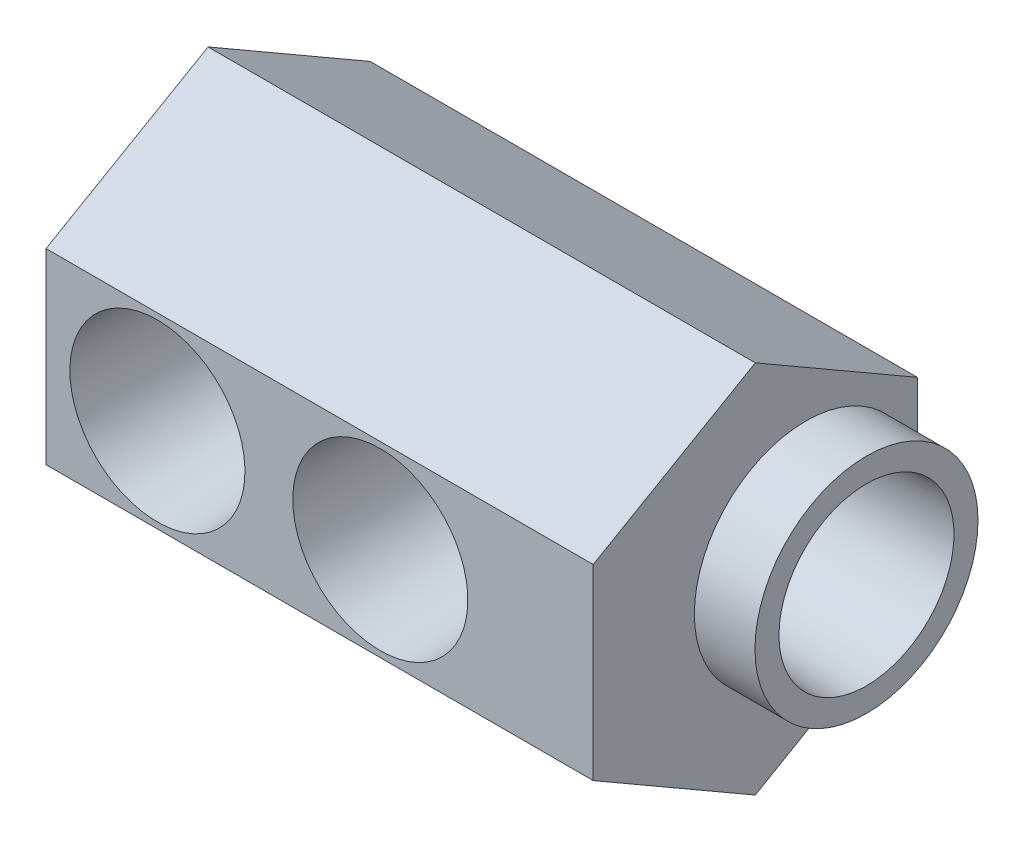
ISO-10303-21;
HEADER;
FILE_DESCRIPTION(('STEP AP214'),'2;1');
FILE_NAME('part.step','',(''),(''),'','','');
FILE_SCHEMA(('AUTOMOTIVE_DESIGN { 1 0 10303 214 1 1 1 1 }'));
ENDSEC;
DATA;
#1=APPLICATION_CONTEXT('core data for automotive mechanical design processes');
#2=APPLICATION_PROTOCOL_DEFINITION('international standard','automotive_design',2000,#1);
#3=PRODUCT_CONTEXT('',#1,'mechanical');
#4=PRODUCT('Part','Part','',(#3));
#5=PRODUCT_RELATED_PRODUCT_CATEGORY('part','',(#4));
#6=PRODUCT_DEFINITION_FORMATION('','',#4);
#7=PRODUCT_DEFINITION_CONTEXT('part definition',#1,'design');
#8=PRODUCT_DEFINITION('design','',#6,#7);
#9=PRODUCT_DEFINITION_SHAPE('','',#8);
#10=(LENGTH_UNIT() NAMED_UNIT(*) SI_UNIT(.MILLI.,.METRE.));
#11=(NAMED_UNIT(*) PLANE_ANGLE_UNIT() SI_UNIT($,.RADIAN.));
#12=(NAMED_UNIT(*) SI_UNIT($,.STERADIAN.) SOLID_ANGLE_UNIT());
#13=UNCERTAINTY_MEASURE_WITH_UNIT(LENGTH_MEASURE(1.E-05),#10,'distance_accuracy_value','');
#14=(GEOMETRIC_REPRESENTATION_CONTEXT(3) GLOBAL_UNCERTAINTY_ASSIGNED_CONTEXT((#13)) GLOBAL_UNIT_ASSIGNED_CONTEXT((#10,
#11,#12)) REPRESENTATION_CONTEXT('',''));
#15=CARTESIAN_POINT('',(0.,0.,0.));
#16=DIRECTION('',(0.,0.,1.));
#17=DIRECTION('',(1.,0.,0.));
#18=AXIS2_PLACEMENT_3D('',#15,#16,#17);
#19=CARTESIAN_POINT('',(47.625,0.,8.7376));
#20=DIRECTION('',(-1.,0.,0.));
#21=DIRECTION('',(0.,0.,1.));
#22=AXIS2_PLACEMENT_3D('',#19,#20,#21);
#23=PLANE('',#22);
#24=CARTESIAN_POINT('',(47.625,0.,8.7376));
#25=DIRECTION('',(-1.,0.,0.));
#26=DIRECTION('',(0.,1.,0.));
#27=AXIS2_PLACEMENT_3D('',#24,#25,#26);
#28=CIRCLE('',#27,8.7376);
#29=CARTESIAN_POINT('',(47.625,8.7376,8.7376));
#30=VERTEX_POINT('',#29);
#31=EDGE_CURVE('E199',#30,#30,#28,.T.);
#32=ORIENTED_EDGE('',*,*,#31,.F.);
#33=EDGE_LOOP('',(#32));
#34=FACE_BOUND('',#33,.T.);
#35=CARTESIAN_POINT('',(47.625,0.,8.7376));
#36=DIRECTION('',(-1.,0.,0.));
#37=DIRECTION('',(0.,0.,1.));
#38=AXIS2_PLACEMENT_3D('',#35,#36,#37);
#39=CIRCLE('',#38,6.85802318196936);
#40=CARTESIAN_POINT('',(47.625,0.,15.5956231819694));
#41=VERTEX_POINT('',#40);
#42=EDGE_CURVE('E384',#41,#41,#39,.T.);
#43=ORIENTED_EDGE('',*,*,#42,.T.);
#44=EDGE_LOOP('',(#43));
#45=FACE_BOUND('',#44,.T.);
#46=ADVANCED_FACE('F16',(#34,#45),#23,.F.);
#47=CARTESIAN_POINT('',(8.73125,0.,3.24017419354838));
#48=DIRECTION('',(0.,0.,-1.));
#49=DIRECTION('',(-1.,0.,0.));
#50=AXIS2_PLACEMENT_3D('',#47,#48,#49);
#51=CYLINDRICAL_SURFACE('',#50,5.55625);
#52=CARTESIAN_POINT('',(8.73125,0.,13.2293295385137));
#53=DIRECTION('',(0.,0.,-1.));
#54=DIRECTION('',(-1.,0.,0.));
#55=AXIS2_PLACEMENT_3D('',#52,#53,#54);
#56=CIRCLE('',#55,5.55625);
#57=CARTESIAN_POINT('',(3.175,0.,13.2293295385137));
#58=VERTEX_POINT('',#57);
#59=EDGE_CURVE('E222',#58,#58,#56,.T.);
#60=ORIENTED_EDGE('',*,*,#59,.F.);
#61=EDGE_LOOP('',(#60));
#62=FACE_BOUND('',#61,.T.);
#63=CARTESIAN_POINT('',(8.73125,0.,5.81662318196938));
#64=DIRECTION('',(0.,0.,-1.));
#65=DIRECTION('',(-1.,0.,0.));
#66=AXIS2_PLACEMENT_3D('',#63,#64,#65);
#67=CIRCLE('',#66,5.55625);
#68=CARTESIAN_POINT('',(14.2874756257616,-0.0164577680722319,5.81662318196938));
#69=VERTEX_POINT('',#68);
#70=CARTESIAN_POINT('',(14.2874756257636,0.016457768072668,5.81662318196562));
#71=VERTEX_POINT('',#70);
#72=EDGE_CURVE('E225',#69,#71,#67,.T.);
#73=ORIENTED_EDGE('',*,*,#72,.T.);
#74=CARTESIAN_POINT('',(14.2875,0.,11.6586231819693));
#75=CARTESIAN_POINT('',(14.2874896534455,-0.15259620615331,11.6586111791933));
#76=CARTESIAN_POINT('',(14.2811471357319,-0.305352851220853,11.6465945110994));
#77=CARTESIAN_POINT('',(14.2563955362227,-0.606286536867,11.5990837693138));
#78=CARTESIAN_POINT('',(14.237966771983,-0.754455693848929,11.5635513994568));
#79=CARTESIAN_POINT('',(14.1909586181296,-1.04142033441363,11.4708153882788));
#80=CARTESIAN_POINT('',(14.1624199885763,-1.18025083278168,11.4136987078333));
#81=CARTESIAN_POINT('',(14.0977578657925,-1.44611723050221,11.2799010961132));
#82=CARTESIAN_POINT('',(14.0616344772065,-1.57315329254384,11.2032204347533));
#83=CARTESIAN_POINT('',(13.9823036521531,-1.82109036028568,11.026840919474));
#84=CARTESIAN_POINT('',(13.9387887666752,-1.9410595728,10.925972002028));
#85=CARTESIAN_POINT('',(13.8504908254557,-2.16324055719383,10.7066582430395));
#86=CARTESIAN_POINT('',(13.805706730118,-2.26543725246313,10.5881986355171));
#87=CARTESIAN_POINT('',(13.7153353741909,-2.45827606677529,10.3244738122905));
#88=CARTESIAN_POINT('',(13.6700240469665,-2.54711079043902,10.1777672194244));
#89=CARTESIAN_POINT('',(13.6092642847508,-2.66059008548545,9.94633632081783));
#90=CARTESIAN_POINT('',(13.5902071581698,-2.69512914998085,9.8672696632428));
#91=CARTESIAN_POINT('',(13.5552265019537,-2.75725124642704,9.70579919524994));
#92=CARTESIAN_POINT('',(13.5393010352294,-2.78483858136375,9.62339748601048));
#93=CARTESIAN_POINT('',(13.512134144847,-2.83120816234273,9.46101134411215));
#94=CARTESIAN_POINT('',(13.5006649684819,-2.8504274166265,9.38118968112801));
#95=CARTESIAN_POINT('',(13.4815807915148,-2.88211974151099,9.21980284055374));
#96=CARTESIAN_POINT('',(13.4739636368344,-2.89459658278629,9.13823866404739));
#97=CARTESIAN_POINT('',(13.4629292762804,-2.91260026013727,8.97411952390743));
#98=CARTESIAN_POINT('',(13.4595088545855,-2.91813241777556,8.89156536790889));
#99=CARTESIAN_POINT('',(13.4570108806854,-2.92217297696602,8.72624813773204));
#100=CARTESIAN_POINT('',(13.4579328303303,-2.92068218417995,8.64348508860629));
#101=CARTESIAN_POINT('',(13.4663528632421,-2.90703905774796,8.4185200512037));
#102=CARTESIAN_POINT('',(13.4781425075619,-2.88792697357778,8.27682524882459));
#103=CARTESIAN_POINT('',(13.5130659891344,-2.82970982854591,7.99915201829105));
#104=CARTESIAN_POINT('',(13.5362041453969,-2.79059715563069,7.86317578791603));
#105=CARTESIAN_POINT('',(13.5916565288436,-2.69287438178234,7.59681806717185));
#106=CARTESIAN_POINT('',(13.6241676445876,-2.63384072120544,7.46663439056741));
#107=CARTESIAN_POINT('',(13.6947461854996,-2.49828969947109,7.21737534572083));
#108=CARTESIAN_POINT('',(13.7328160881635,-2.42176453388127,7.09830496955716));
#109=CARTESIAN_POINT('',(13.816745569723,-2.240747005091,6.85682529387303));
#110=CARTESIAN_POINT('',(13.8629431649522,-2.13382537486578,6.73634759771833));
#111=CARTESIAN_POINT('',(13.953590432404,-1.90122661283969,6.51417949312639));
#112=CARTESIAN_POINT('',(13.9980390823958,-1.77553871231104,6.41249994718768));
#113=CARTESIAN_POINT('',(14.0832180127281,-1.50008532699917,6.2253585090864));
#114=CARTESIAN_POINT('',(14.1235977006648,-1.3493622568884,6.14113310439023));
#115=CARTESIAN_POINT('',(14.1929742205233,-1.03323698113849,5.99995715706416));
#116=CARTESIAN_POINT('',(14.2219809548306,-0.867847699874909,5.94298287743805));
#117=CARTESIAN_POINT('',(14.2631394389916,-0.542727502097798,5.8630001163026));
#118=CARTESIAN_POINT('',(14.276553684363,-0.383787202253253,5.83743593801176));
#119=CARTESIAN_POINT('',(14.2894474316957,-0.0633361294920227,5.81285320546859));
#120=CARTESIAN_POINT('',(14.2889346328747,0.0981731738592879,5.81381998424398));
#121=CARTESIAN_POINT('',(14.2747173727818,0.404088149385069,5.84094786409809));
#122=CARTESIAN_POINT('',(14.2621723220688,0.548752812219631,5.86489474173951));
#123=CARTESIAN_POINT('',(14.2267538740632,0.831675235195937,5.93369322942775));
#124=CARTESIAN_POINT('',(14.2038793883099,0.969932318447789,5.97854704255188));
#125=CARTESIAN_POINT('',(14.1490945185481,1.2403273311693,6.08885556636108));
#126=CARTESIAN_POINT('',(14.1169652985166,1.37221377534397,6.15481410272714));
#127=CARTESIAN_POINT('',(14.04664238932,1.62344149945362,6.30485449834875));
#128=CARTESIAN_POINT('',(14.0084462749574,1.74277773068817,6.38894360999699));
#129=CARTESIAN_POINT('',(13.9248124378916,1.97891877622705,6.58306704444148));
#130=CARTESIAN_POINT('',(13.8790359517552,2.09412511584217,6.69490359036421));
#131=CARTESIAN_POINT('',(13.7881677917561,2.30492907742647,6.93610234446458));
#132=CARTESIAN_POINT('',(13.7430767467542,2.40050959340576,7.06547967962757));
#133=CARTESIAN_POINT('',(13.6557324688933,2.57517665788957,7.34832460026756));
#134=CARTESIAN_POINT('',(13.6138350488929,2.65285121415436,7.50279459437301));
#135=CARTESIAN_POINT('',(13.5602699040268,2.74841964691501,7.74457321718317));
#136=CARTESIAN_POINT('',(13.5439608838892,2.77678645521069,7.82685103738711));
#137=CARTESIAN_POINT('',(13.5151191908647,2.82618660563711,7.9942030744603));
#138=CARTESIAN_POINT('',(13.5025839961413,2.84722484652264,8.07927538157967));
#139=CARTESIAN_POINT('',(13.4828953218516,2.87994941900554,8.24307900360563));
#140=CARTESIAN_POINT('',(13.4753364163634,2.89234733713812,8.32162029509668));
#141=CARTESIAN_POINT('',(13.4640974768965,2.91070188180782,8.47969137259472));
#142=CARTESIAN_POINT('',(13.4604153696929,2.91666195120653,8.55922060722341));
#143=CARTESIAN_POINT('',(13.4570897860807,2.92204798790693,8.71856620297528));
#144=CARTESIAN_POINT('',(13.4574451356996,2.92147585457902,8.79838247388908));
#145=CARTESIAN_POINT('',(13.4621667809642,2.91382109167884,8.95755809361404));
#146=CARTESIAN_POINT('',(13.4665328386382,2.90673884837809,9.03691746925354));
#147=CARTESIAN_POINT('',(13.4839443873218,2.87824767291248,9.25505555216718));
#148=CARTESIAN_POINT('',(13.501079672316,2.85001452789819,9.39268570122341));
#149=CARTESIAN_POINT('',(13.5452382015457,2.77476023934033,9.66093584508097));
#150=CARTESIAN_POINT('',(13.5722649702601,2.72773239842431,9.79155332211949));
#151=CARTESIAN_POINT('',(13.6352781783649,2.61284865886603,10.0517219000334));
#152=CARTESIAN_POINT('',(13.6717352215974,2.54383110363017,10.1806437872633));
#153=CARTESIAN_POINT('',(13.7488608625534,2.38810346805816,10.4259340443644));
#154=CARTESIAN_POINT('',(13.7895317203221,2.30138386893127,10.5422956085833));
#155=CARTESIAN_POINT('',(13.8772656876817,2.09863618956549,10.7760458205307));
#156=CARTESIAN_POINT('',(13.9244305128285,1.98020868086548,10.8913226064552));
#157=CARTESIAN_POINT('',(14.0148356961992,1.72452153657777,11.1010091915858));
#158=CARTESIAN_POINT('',(14.0580736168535,1.58725033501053,11.1954060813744));
#159=CARTESIAN_POINT('',(14.1169832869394,1.36810411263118,11.3198355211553));
#160=CARTESIAN_POINT('',(14.1357898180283,1.29199681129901,11.3587585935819));
#161=CARTESIAN_POINT('',(14.1706822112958,1.13615616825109,11.4299693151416));
#162=CARTESIAN_POINT('',(14.1867694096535,1.05642463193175,11.4622602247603));
#163=CARTESIAN_POINT('',(14.2157134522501,0.894070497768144,11.5197604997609));
#164=CARTESIAN_POINT('',(14.2285769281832,0.811454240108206,11.5449844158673));
#165=CARTESIAN_POINT('',(14.2507105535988,0.643897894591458,11.5880823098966));
#166=CARTESIAN_POINT('',(14.2599827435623,0.558959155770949,11.6059604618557));
#167=CARTESIAN_POINT('',(14.2739773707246,0.395235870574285,11.6328390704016));
#168=CARTESIAN_POINT('',(14.2790348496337,0.316587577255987,11.642495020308));
#169=CARTESIAN_POINT('',(14.285798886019,0.15864065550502,11.6553902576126));
#170=CARTESIAN_POINT('',(14.2875053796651,0.0793420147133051,11.6586294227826));
#171=CARTESIAN_POINT('',(14.2875,0.,11.6586231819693));
#172=B_SPLINE_CURVE_WITH_KNOTS('',3,(#74,#75,#76,#77,#78,#79,#80,#81,#82,#83,#84,#85,#86,#87,
#88,#89,#90,#91,#92,#93,#94,#95,#96,#97,#98,#99,#100,#101,#102,#103,#104,#105,#106,#107,#108,
#109,#110,#111,#112,#113,#114,#115,#116,#117,#118,#119,#120,#121,#122,#123,#124,#125,#126,#127,
#128,#129,#130,#131,#132,#133,#134,#135,#136,#137,#138,#139,#140,#141,#142,#143,#144,#145,#146,
#147,#148,#149,#150,#151,#152,#153,#154,#155,#156,#157,#158,#159,#160,#161,#162,#163,#164,#165,
#166,#167,#168,#169,#170,#171),.UNSPECIFIED.,.T.,.F.,(4,2,2,2,2,2,2,2,2,2,2,2,2,2,2,2,2,2,2,2,2,
2,2,2,2,2,2,2,2,2,2,2,2,2,2,2,2,2,2,2,2,2,2,2,2,2,2,2,4),(0.,0.457481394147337,
0.915709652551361,1.3721111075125,1.82850626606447,2.31449222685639,2.80088846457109,
3.33007409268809,3.59484099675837,3.85944361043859,4.10778110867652,4.35597958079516,
4.603987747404,4.85196746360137,5.28013319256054,5.70846199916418,6.14654100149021,
6.58481585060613,7.0853946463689,7.58626180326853,8.11534843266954,8.6439733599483,
9.12590436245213,9.60756894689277,10.047043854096,10.4865650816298,10.9374783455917,
11.3885723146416,11.887308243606,12.3864770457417,12.9169799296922,13.1822678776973,
13.4473781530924,13.6866517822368,13.9257973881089,14.1648734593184,14.4039353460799,
14.8264992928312,15.2492139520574,15.6995927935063,16.1502144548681,16.6635646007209,
17.1772312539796,17.4395064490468,17.7016523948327,17.9632545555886,18.2247078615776,
18.4625696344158,18.7004359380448),.UNSPECIFIED.);
#173=EDGE_CURVE('E145',#71,#69,#172,.T.);
#174=ORIENTED_EDGE('',*,*,#173,.T.);
#175=EDGE_LOOP('',(#73,#174));
#176=FACE_BOUND('',#175,.T.);
#177=ADVANCED_FACE('F240',(#62,#176),#51,.F.);
#178=CARTESIAN_POINT('',(8.73125,0.,5.81662318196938));
#179=DIRECTION('',(0.,0.,1.));
#180=DIRECTION('',(1.,0.,0.));
#181=AXIS2_PLACEMENT_3D('',#178,#179,#180);
#182=PLANE('',#181);
#183=DIRECTION('',(0.,1.,0.));
#184=VECTOR('',#183,1.);
#185=CARTESIAN_POINT('',(8.73125,0.,5.81662318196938));
#186=LINE('',#185,#184);
#187=CARTESIAN_POINT('',(8.73125,-0.0164577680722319,5.81662318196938));
#188=VERTEX_POINT('',#187);
#189=CARTESIAN_POINT('',(8.73125,0.0164577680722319,5.81662318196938));
#190=VERTEX_POINT('',#189);
#191=EDGE_CURVE('E151',#188,#190,#186,.T.);
#192=ORIENTED_EDGE('',*,*,#191,.T.);
#193=DIRECTION('',(-1.,0.,0.));
#194=VECTOR('',#193,1.);
#195=CARTESIAN_POINT('',(52.3612796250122,0.0164577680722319,5.81662318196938));
#196=LINE('',#195,#194);
#197=EDGE_CURVE('E30',#190,#71,#196,.F.);
#198=ORIENTED_EDGE('',*,*,#197,.T.);
#199=ORIENTED_EDGE('',*,*,#72,.F.);
#200=DIRECTION('',(-1.,0.,0.));
#201=VECTOR('',#200,1.);
#202=CARTESIAN_POINT('',(52.3612796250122,-0.0164577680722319,5.81662318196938));
#203=LINE('',#202,#201);
#204=EDGE_CURVE('E148',#69,#188,#203,.T.);
#205=ORIENTED_EDGE('',*,*,#204,.T.);
#206=EDGE_LOOP('',(#192,#198,#199,#205));
#207=FACE_BOUND('',#206,.T.);
#208=ADVANCED_FACE('F256',(#207),#182,.T.);
#209=CARTESIAN_POINT('',(26.19375,0.,37.2802064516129));
#210=DIRECTION('',(0.,0.,-1.));
#211=DIRECTION('',(-1.,0.,0.));
#212=AXIS2_PLACEMENT_3D('',#209,#210,#211);
#213=CYLINDRICAL_SURFACE('',#212,5.55625);
#214=CARTESIAN_POINT('',(20.6375,0.,12.0523));
#215=CARTESIAN_POINT('',(20.6375006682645,0.0848998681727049,12.0522992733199));
#216=CARTESIAN_POINT('',(20.6394510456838,0.169823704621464,12.0490328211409));
#217=CARTESIAN_POINT('',(20.6472055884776,0.339030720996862,12.036009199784));
#218=CARTESIAN_POINT('',(20.6530120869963,0.423313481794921,12.0262481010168));
#219=CARTESIAN_POINT('',(20.6683509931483,0.590722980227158,12.000339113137));
#220=CARTESIAN_POINT('',(20.6778906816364,0.673847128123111,11.9841787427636));
#221=CARTESIAN_POINT('',(20.7004575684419,0.838182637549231,11.9456870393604));
#222=CARTESIAN_POINT('',(20.7134862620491,0.919393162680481,11.9233530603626));
#223=CARTESIAN_POINT('',(20.7572128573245,1.15846258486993,11.8477406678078));
#224=CARTESIAN_POINT('',(20.7926508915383,1.31278558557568,11.7856889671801));
#225=CARTESIAN_POINT('',(20.8731373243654,1.60826775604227,11.6406782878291));
#226=CARTESIAN_POINT('',(20.9181831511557,1.74943043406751,11.5577249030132));
#227=CARTESIAN_POINT('',(21.018117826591,2.02683861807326,11.3662260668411));
#228=CARTESIAN_POINT('',(21.0734945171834,2.16189544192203,11.2562149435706));
#229=CARTESIAN_POINT('',(21.1868221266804,2.41279729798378,11.0170191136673));
#230=CARTESIAN_POINT('',(21.2447762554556,2.52861747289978,10.8878100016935));
#231=CARTESIAN_POINT('',(21.3650287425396,2.75196381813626,10.5954878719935));
#232=CARTESIAN_POINT('',(21.4270052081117,2.85679430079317,10.4301644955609));
#233=CARTESIAN_POINT('',(21.5395924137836,3.03678309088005,10.0806063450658));
#234=CARTESIAN_POINT('',(21.5902214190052,3.11198923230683,9.89640266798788));
#235=CARTESIAN_POINT('',(21.661695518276,3.2148628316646,9.55924527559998));
#236=CARTESIAN_POINT('',(21.6867672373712,3.24959670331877,9.40934725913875));
#237=CARTESIAN_POINT('',(21.7220037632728,3.29792815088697,9.10453594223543));
#238=CARTESIAN_POINT('',(21.7321867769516,3.31155154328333,8.94962900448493));
#239=CARTESIAN_POINT('',(21.7361449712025,3.31687918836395,8.6389309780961));
#240=CARTESIAN_POINT('',(21.7298892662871,3.30854218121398,8.48313877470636));
#241=CARTESIAN_POINT('',(21.70186851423,3.27038915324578,8.17560124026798));
#242=CARTESIAN_POINT('',(21.6800919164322,3.24055713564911,8.0238590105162));
#243=CARTESIAN_POINT('',(21.6243558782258,3.16145974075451,7.72996747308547));
#244=CARTESIAN_POINT('',(21.5905420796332,3.1124260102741,7.58772664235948));
#245=CARTESIAN_POINT('',(21.5143900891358,2.99671392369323,7.31310864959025));
#246=CARTESIAN_POINT('',(21.4720487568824,2.93002906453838,7.18073514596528));
#247=CARTESIAN_POINT('',(21.3747487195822,2.76759060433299,6.90525821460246));
#248=CARTESIAN_POINT('',(21.3188746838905,2.66880321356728,6.76426446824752));
#249=CARTESIAN_POINT('',(21.2057867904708,2.45096949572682,6.49941895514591));
#250=CARTESIAN_POINT('',(21.1485717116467,2.33190403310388,6.37558358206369));
#251=CARTESIAN_POINT('',(21.0300359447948,2.05745912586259,6.13142170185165));
#252=CARTESIAN_POINT('',(20.9692162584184,1.89934283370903,6.01386647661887));
#253=CARTESIAN_POINT('',(20.8863182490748,1.64651433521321,5.85905395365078));
#254=CARTESIAN_POINT('',(20.8600645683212,1.55958796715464,5.81102030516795));
#255=CARTESIAN_POINT('',(20.8110626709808,1.38099210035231,5.72263669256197));
#256=CARTESIAN_POINT('',(20.7883123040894,1.28932555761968,5.68228201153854));
#257=CARTESIAN_POINT('',(20.7483212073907,1.10783713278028,5.61209316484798));
#258=CARTESIAN_POINT('',(20.7308225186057,1.01826711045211,5.58175401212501));
#259=CARTESIAN_POINT('',(20.7000136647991,0.83623397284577,5.52871739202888));
#260=CARTESIAN_POINT('',(20.6867011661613,0.74377250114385,5.50601566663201));
#261=CARTESIAN_POINT('',(20.6646656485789,0.556773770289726,5.46860560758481));
#262=CARTESIAN_POINT('',(20.6559393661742,0.462238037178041,5.45389158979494));
#263=CARTESIAN_POINT('',(20.6433395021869,0.271933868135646,5.43268670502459));
#264=CARTESIAN_POINT('',(20.6394652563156,0.176165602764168,5.42619471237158));
#265=CARTESIAN_POINT('',(20.6368804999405,-0.00274738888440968,5.42186133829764));
#266=CARTESIAN_POINT('',(20.6375460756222,-0.0858591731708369,5.4229747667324));
#267=CARTESIAN_POINT('',(20.64258086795,-0.251661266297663,5.43142284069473));
#268=CARTESIAN_POINT('',(20.6469512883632,-0.334351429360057,5.43875950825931));
#269=CARTESIAN_POINT('',(20.6654933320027,-0.580774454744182,5.469991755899));
#270=CARTESIAN_POINT('',(20.6850933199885,-0.743049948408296,5.50310528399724));
#271=CARTESIAN_POINT('',(20.7363849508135,-1.05529159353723,5.59127014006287));
#272=CARTESIAN_POINT('',(20.7677949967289,-1.20545240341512,5.64581180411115));
#273=CARTESIAN_POINT('',(20.8401912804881,-1.49449947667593,5.77470371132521));
#274=CARTESIAN_POINT('',(20.8811794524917,-1.63338345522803,5.84905795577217));
#275=CARTESIAN_POINT('',(20.9743880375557,-1.91150931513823,6.02409363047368));
#276=CARTESIAN_POINT('',(21.0273331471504,-2.04928760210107,6.12670835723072));
#277=CARTESIAN_POINT('',(21.1370139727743,-2.30671992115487,6.3510780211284));
#278=CARTESIAN_POINT('',(21.1937540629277,-2.42635250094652,6.47285527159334));
#279=CARTESIAN_POINT('',(21.3135439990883,-2.65985525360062,6.7502963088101));
#280=CARTESIAN_POINT('',(21.3764707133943,-2.77102268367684,6.90830275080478));
#281=CARTESIAN_POINT('',(21.4935403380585,-2.9652705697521,7.24366324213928));
#282=CARTESIAN_POINT('',(21.5476928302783,-3.04838177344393,7.42099582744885));
#283=CARTESIAN_POINT('',(21.628943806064,-3.16836543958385,7.75141976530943));
#284=CARTESIAN_POINT('',(21.6593598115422,-3.21134894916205,7.90146793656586));
#285=CARTESIAN_POINT('',(21.7057564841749,-3.27588840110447,8.2081933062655));
#286=CARTESIAN_POINT('',(21.7217567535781,-3.29747344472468,8.36486119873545));
#287=CARTESIAN_POINT('',(21.7369709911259,-3.31801462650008,8.68108111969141));
#288=CARTESIAN_POINT('',(21.7361258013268,-3.31689101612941,8.84064134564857));
#289=CARTESIAN_POINT('',(21.7176364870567,-3.29189001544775,9.15701215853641));
#290=CARTESIAN_POINT('',(21.6999829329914,-3.26799985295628,9.31382115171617));
#291=CARTESIAN_POINT('',(21.6516365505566,-3.20042554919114,9.61343308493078));
#292=CARTESIAN_POINT('',(21.6215535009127,-3.15766140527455,9.75654873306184));
#293=CARTESIAN_POINT('',(21.5519202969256,-3.05437348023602,10.033725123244));
#294=CARTESIAN_POINT('',(21.5123665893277,-2.99384303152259,10.1677824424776));
#295=CARTESIAN_POINT('',(21.4208349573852,-2.846023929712,10.4451565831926));
#296=CARTESIAN_POINT('',(21.3678817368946,-2.75604928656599,10.5867170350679));
#297=CARTESIAN_POINT('',(21.2592344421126,-2.55644202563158,10.8541330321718));
#298=CARTESIAN_POINT('',(21.2035381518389,-2.44679331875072,10.979975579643));
#299=CARTESIAN_POINT('',(21.0852845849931,-2.19053379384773,11.2328232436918));
#300=CARTESIAN_POINT('',(21.02303876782,-2.04081916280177,11.3568522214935));
#301=CARTESIAN_POINT('',(20.9074658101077,-1.71935409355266,11.5782050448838));
#302=CARTESIAN_POINT('',(20.8541416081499,-1.54759642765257,11.6755200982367));
#303=CARTESIAN_POINT('',(20.7861500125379,-1.27982168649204,11.7967671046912));
#304=CARTESIAN_POINT('',(20.7657416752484,-1.1905040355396,11.8326406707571));
#305=CARTESIAN_POINT('',(20.7289781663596,-1.00835855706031,11.8966737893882));
#306=CARTESIAN_POINT('',(20.7126206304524,-0.915532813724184,11.9248378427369));
#307=CARTESIAN_POINT('',(20.6845008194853,-0.727402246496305,11.9729557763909));
#308=CARTESIAN_POINT('',(20.6727250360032,-0.632105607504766,11.9929338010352));
#309=CARTESIAN_POINT('',(20.6540844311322,-0.439706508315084,12.0244495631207));
#310=CARTESIAN_POINT('',(20.6472154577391,-0.342605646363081,12.0359944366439));
#311=CARTESIAN_POINT('',(20.6411090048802,-0.204357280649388,12.0462474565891));
#312=CARTESIAN_POINT('',(20.6397566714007,-0.163533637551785,12.0485160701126));
#313=CARTESIAN_POINT('',(20.6379519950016,-0.0818085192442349,12.0515425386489));
#314=CARTESIAN_POINT('',(20.6374996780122,-0.0409070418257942,12.052300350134));
#315=CARTESIAN_POINT('',(20.6375,0.,12.0523));
#316=B_SPLINE_CURVE_WITH_KNOTS('',3,(#214,#215,#216,#217,#218,#219,#220,#221,#222,#223,#224,
#225,#226,#227,#228,#229,#230,#231,#232,#233,#234,#235,#236,#237,#238,#239,#240,#241,#242,#243,
#244,#245,#246,#247,#248,#249,#250,#251,#252,#253,#254,#255,#256,#257,#258,#259,#260,#261,#262,
#263,#264,#265,#266,#267,#268,#269,#270,#271,#272,#273,#274,#275,#276,#277,#278,#279,#280,#281,
#282,#283,#284,#285,#286,#287,#288,#289,#290,#291,#292,#293,#294,#295,#296,#297,#298,#299,#300,
#301,#302,#303,#304,#305,#306,#307,#308,#309,#310,#311,#312,#313,#314,#315),.UNSPECIFIED.,.T.,
.F.,(4,2,2,2,2,2,2,2,2,2,2,2,2,2,2,2,2,2,2,2,2,2,2,2,2,2,2,2,2,2,2,2,2,2,2,2,2,2,2,2,2,2,2,2,2,
2,2,2,2,2,4),(0.,0.254656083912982,0.509466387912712,0.764776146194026,1.02019549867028,
1.52794272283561,2.03555420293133,2.58173686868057,3.12861990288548,3.74162141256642,
4.35362901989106,4.81933942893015,5.28447985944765,5.75049483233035,6.2168569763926,
6.67775821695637,7.13882950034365,7.67972067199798,8.22112511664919,8.83621320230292,
9.14402495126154,9.45164700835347,9.73975475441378,10.0277016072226,10.3154432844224,
10.6031455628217,10.852188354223,11.1013120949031,11.5989968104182,12.0854984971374,
12.5720985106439,13.1092818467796,13.6470953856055,14.2538243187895,14.8598861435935,
15.3349731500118,15.8094131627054,16.2855196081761,16.7618933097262,17.2172454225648,
17.6727686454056,18.1984855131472,18.7246342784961,19.3341634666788,19.9438930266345,
20.2387017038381,20.5333379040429,20.827098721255,21.1206106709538,21.243307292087,
21.3660074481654),.UNSPECIFIED.);
#317=CARTESIAN_POINT('',(20.6375,0.,12.0523));
#318=VERTEX_POINT('',#317);
#319=EDGE_CURVE('E21',#318,#318,#316,.T.);
#320=ORIENTED_EDGE('',*,*,#319,.T.);
#321=EDGE_LOOP('',(#320));
#322=FACE_BOUND('',#321,.T.);
#323=CARTESIAN_POINT('',(26.19375,0.,13.2293295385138));
#324=DIRECTION('',(0.,0.,-1.));
#325=DIRECTION('',(-1.,0.,0.));
#326=AXIS2_PLACEMENT_3D('',#323,#324,#325);
#327=CIRCLE('',#326,5.55625);
#328=CARTESIAN_POINT('',(31.6414346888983,-1.09299844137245,13.2293295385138));
#329=VERTEX_POINT('',#328);
#330=CARTESIAN_POINT('',(31.6414346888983,1.09299844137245,13.2293295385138));
#331=VERTEX_POINT('',#330);
#332=EDGE_CURVE('E144',#329,#331,#327,.T.);
#333=ORIENTED_EDGE('',*,*,#332,.F.);
#334=CARTESIAN_POINT('',(31.6414346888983,-1.09299844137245,13.2293295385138));
#335=CARTESIAN_POINT('',(31.6169490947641,-1.21516001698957,13.1996233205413));
#336=CARTESIAN_POINT('',(31.5885510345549,-1.33528320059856,13.165096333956));
#337=CARTESIAN_POINT('',(31.5248011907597,-1.5705300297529,13.0871970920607));
#338=CARTESIAN_POINT('',(31.4894593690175,-1.68566055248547,13.0438375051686));
#339=CARTESIAN_POINT('',(31.4129799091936,-1.90929550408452,12.9494263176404));
#340=CARTESIAN_POINT('',(31.3718998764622,-2.01785204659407,12.8984508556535));
#341=CARTESIAN_POINT('',(31.2845503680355,-2.22906649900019,12.7892275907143));
#342=CARTESIAN_POINT('',(31.2382790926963,-2.33172234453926,12.7309772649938));
#343=CARTESIAN_POINT('',(31.0935359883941,-2.6291392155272,12.5470627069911));
#344=CARTESIAN_POINT('',(30.9886141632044,-2.81481546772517,12.4116016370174));
#345=CARTESIAN_POINT('',(30.7677468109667,-3.16114479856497,12.1183144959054));
#346=CARTESIAN_POINT('',(30.6517632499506,-3.32170613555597,11.9604102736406));
#347=CARTESIAN_POINT('',(30.4636625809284,-3.55701756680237,11.6931838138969));
#348=CARTESIAN_POINT('',(30.3928586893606,-3.64013654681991,11.5901730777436));
#349=CARTESIAN_POINT('',(30.2512783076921,-3.79730936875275,11.3773413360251));
#350=CARTESIAN_POINT('',(30.1805018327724,-3.8713604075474,11.2675182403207));
#351=CARTESIAN_POINT('',(30.0408647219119,-4.01014903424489,11.0412030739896));
#352=CARTESIAN_POINT('',(29.9720018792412,-4.0748977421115,10.9247192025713));
#353=CARTESIAN_POINT('',(29.8383663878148,-4.19484729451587,10.6847807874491));
#354=CARTESIAN_POINT('',(29.7735913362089,-4.25005378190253,10.5613304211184));
#355=CARTESIAN_POINT('',(29.6391425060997,-4.36005463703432,10.2825268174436));
#356=CARTESIAN_POINT('',(29.5709229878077,-4.41272723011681,10.125604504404));
#357=CARTESIAN_POINT('',(29.4511191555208,-4.50189596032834,9.80125070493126));
#358=CARTESIAN_POINT('',(29.3994972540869,-4.53842871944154,9.63384400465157));
#359=CARTESIAN_POINT('',(29.3271488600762,-4.58861485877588,9.31749013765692));
#360=CARTESIAN_POINT('',(29.30281881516,-4.60497954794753,9.16983109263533));
#361=CARTESIAN_POINT('',(29.2755840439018,-4.62325852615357,8.87170940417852));
#362=CARTESIAN_POINT('',(29.2726544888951,-4.62518956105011,8.72125021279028));
#363=CARTESIAN_POINT('',(29.2887054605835,-4.6144592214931,8.42227270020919));
#364=CARTESIAN_POINT('',(29.3076629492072,-4.60181319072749,8.27375250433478));
#365=CARTESIAN_POINT('',(29.364222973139,-4.56301903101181,7.98203371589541));
#366=CARTESIAN_POINT('',(29.4018586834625,-4.53684687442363,7.83884508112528));
#367=CARTESIAN_POINT('',(29.4813063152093,-4.47947928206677,7.58991418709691));
#368=CARTESIAN_POINT('',(29.5204718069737,-4.45058072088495,7.48275033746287));
#369=CARTESIAN_POINT('',(29.6051121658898,-4.38604084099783,7.27303084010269));
#370=CARTESIAN_POINT('',(29.6505891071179,-4.35039730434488,7.17047672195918));
#371=CARTESIAN_POINT('',(29.7461495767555,-4.27272448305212,6.96962355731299));
#372=CARTESIAN_POINT('',(29.796247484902,-4.23067498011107,6.87133929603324));
#373=CARTESIAN_POINT('',(29.899425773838,-4.14060090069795,6.67921301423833));
#374=CARTESIAN_POINT('',(29.9525059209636,-4.09257679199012,6.58537064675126));
#375=CARTESIAN_POINT('',(30.081961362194,-3.97045074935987,6.36540015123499));
#376=CARTESIAN_POINT('',(30.159192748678,-3.89358171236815,6.24130355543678));
#377=CARTESIAN_POINT('',(30.3145491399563,-3.72877674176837,6.00123259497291));
#378=CARTESIAN_POINT('',(30.3926744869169,-3.6408364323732,5.88526147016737));
#379=CARTESIAN_POINT('',(30.5475772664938,-3.45409793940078,5.6617831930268));
#380=CARTESIAN_POINT('',(30.6243565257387,-3.35531604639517,5.55426374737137));
#381=CARTESIAN_POINT('',(30.7747992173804,-3.14681568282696,5.34800674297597));
#382=CARTESIAN_POINT('',(30.8484623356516,-3.03709611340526,5.24927006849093));
#383=CARTESIAN_POINT('',(31.0296178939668,-2.74407311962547,5.01027255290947));
#384=CARTESIAN_POINT('',(31.133758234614,-2.55316626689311,4.87657923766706));
#385=CARTESIAN_POINT('',(31.3234902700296,-2.14660197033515,4.63662991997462));
#386=CARTESIAN_POINT('',(31.4091058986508,-1.93097702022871,4.53033847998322));
#387=CARTESIAN_POINT('',(31.5431651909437,-1.51500653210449,4.36535535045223));
#388=CARTESIAN_POINT('',(31.595389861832,-1.31787986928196,4.30173357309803));
#389=CARTESIAN_POINT('',(31.6576234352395,-1.01425724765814,4.22622858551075));
#390=CARTESIAN_POINT('',(31.67567958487,-0.911775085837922,4.20438684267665));
#391=CARTESIAN_POINT('',(31.7061127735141,-0.704761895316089,4.16763088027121));
#392=CARTESIAN_POINT('',(31.7184925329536,-0.600231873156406,4.15271334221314));
#393=CARTESIAN_POINT('',(31.7350213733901,-0.415469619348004,4.13281151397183));
#394=CARTESIAN_POINT('',(31.7404398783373,-0.335509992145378,4.12629384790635));
#395=CARTESIAN_POINT('',(31.7478157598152,-0.175254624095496,4.11742529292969));
#396=CARTESIAN_POINT('',(31.7497754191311,-0.0949591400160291,4.11507165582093));
#397=CARTESIAN_POINT('',(31.7499807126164,-0.0146400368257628,4.11482318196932));
#398=B_SPLINE_CURVE_WITH_KNOTS('',3,(#334,#335,#336,#337,#338,#339,#340,#341,#342,#343,#344,
#345,#346,#347,#348,#349,#350,#351,#352,#353,#354,#355,#356,#357,#358,#359,#360,#361,#362,#363,
#364,#365,#366,#367,#368,#369,#370,#371,#372,#373,#374,#375,#376,#377,#378,#379,#380,#381,#382,
#383,#384,#385,#386,#387,#388,#389,#390,#391,#392,#393,#394,#395,#396,#397),.UNSPECIFIED.,.F.,
.F.,(4,2,2,2,2,2,2,2,2,2,2,2,2,2,2,2,2,2,2,2,2,2,2,2,2,2,2,2,2,2,2,4),(0.,0.383972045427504,
0.767397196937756,1.14721804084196,1.52717096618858,2.28209770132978,3.03972074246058,
3.48967761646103,3.9397732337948,4.38932625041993,4.83861250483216,5.37431782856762,
5.90880129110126,6.35844070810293,6.80755837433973,7.2562037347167,7.70564881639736,
8.05826835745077,8.41100405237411,8.76487703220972,9.11872232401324,9.61353357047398,
10.1085410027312,10.6028145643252,11.0971378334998,11.8598992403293,12.621669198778,
13.2595413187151,13.5781932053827,13.8966922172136,14.1377410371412,14.3786307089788),.UNSPECIFIED.);
#399=CARTESIAN_POINT('',(31.7499807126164,-0.0146400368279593,4.11482318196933));
#400=VERTEX_POINT('',#399);
#401=EDGE_CURVE('E122',#329,#400,#398,.T.);
#402=ORIENTED_EDGE('',*,*,#401,.T.);
#403=CARTESIAN_POINT('',(26.19375,0.,4.11482318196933));
#404=DIRECTION('',(0.,0.,-1.));
#405=DIRECTION('',(-1.,0.,0.));
#406=AXIS2_PLACEMENT_3D('',#403,#404,#405);
#407=CIRCLE('',#406,5.55625);
#408=CARTESIAN_POINT('',(31.7499807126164,0.0146400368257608,4.11482318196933));
#409=VERTEX_POINT('',#408);
#410=EDGE_CURVE('E121',#400,#409,#407,.T.);
#411=ORIENTED_EDGE('',*,*,#410,.T.);
#412=CARTESIAN_POINT('',(31.7499807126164,0.0146400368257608,4.11482318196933));
#413=CARTESIAN_POINT('',(31.7497164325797,0.12520901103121,4.11514743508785));
#414=CARTESIAN_POINT('',(31.7460988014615,0.235738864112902,4.11948915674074));
#415=CARTESIAN_POINT('',(31.7323672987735,0.455728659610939,4.13600411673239));
#416=CARTESIAN_POINT('',(31.7222580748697,0.565189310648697,4.14817175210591));
#417=CARTESIAN_POINT('',(31.6958550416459,0.781373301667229,4.18001294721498));
#418=CARTESIAN_POINT('',(31.6796095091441,0.888111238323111,4.19962792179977));
#419=CARTESIAN_POINT('',(31.6412901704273,1.09895385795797,4.2460265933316));
#420=CARTESIAN_POINT('',(31.6192156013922,1.20305819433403,4.27281122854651));
#421=CARTESIAN_POINT('',(31.5697522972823,1.40767878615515,4.33304990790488));
#422=CARTESIAN_POINT('',(31.5423788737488,1.50820441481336,4.36648474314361));
#423=CARTESIAN_POINT('',(31.4827852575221,1.70547853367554,4.4396114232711));
#424=CARTESIAN_POINT('',(31.450563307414,1.80222563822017,4.47930553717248));
#425=CARTESIAN_POINT('',(31.3473077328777,2.08646789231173,4.60721468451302));
#426=CARTESIAN_POINT('',(31.2697327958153,2.26777004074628,4.70419822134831));
#427=CARTESIAN_POINT('',(31.128307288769,2.55719827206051,4.88399854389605));
#428=CARTESIAN_POINT('',(31.0678532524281,2.67035899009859,4.96162484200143));
#429=CARTESIAN_POINT('',(30.9422717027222,2.88776526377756,5.12518060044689));
#430=CARTESIAN_POINT('',(30.8771441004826,2.99201064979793,5.21111021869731));
#431=CARTESIAN_POINT('',(30.743412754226,3.19170324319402,5.39074983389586));
#432=CARTESIAN_POINT('',(30.6748005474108,3.28712727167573,5.48447916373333));
#433=CARTESIAN_POINT('',(30.5356350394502,3.46886739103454,5.67901302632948));
#434=CARTESIAN_POINT('',(30.4650819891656,3.55518465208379,5.77981664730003));
#435=CARTESIAN_POINT('',(30.3221877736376,3.72022104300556,5.99015789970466));
#436=CARTESIAN_POINT('',(30.2498376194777,3.79877079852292,6.09982226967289));
#437=CARTESIAN_POINT('',(30.1063836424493,3.94636559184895,6.32622120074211));
#438=CARTESIAN_POINT('',(30.035280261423,4.01540731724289,6.4429582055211));
#439=CARTESIAN_POINT('',(29.8967032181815,4.14354024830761,6.68336905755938));
#440=CARTESIAN_POINT('',(29.8292207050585,4.20265654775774,6.80702432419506));
#441=CARTESIAN_POINT('',(29.7005794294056,4.3105805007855,7.06180432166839));
#442=CARTESIAN_POINT('',(29.6394150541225,4.35939734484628,7.19292225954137));
#443=CARTESIAN_POINT('',(29.5221950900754,4.44963912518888,7.4747610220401));
#444=CARTESIAN_POINT('',(29.4670439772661,4.49005443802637,7.62619546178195));
#445=CARTESIAN_POINT('',(29.3749140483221,4.55580801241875,7.93759334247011));
#446=CARTESIAN_POINT('',(29.3378902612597,4.58118361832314,8.09753457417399));
#447=CARTESIAN_POINT('',(29.3003696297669,4.60662997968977,8.3424662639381));
#448=CARTESIAN_POINT('',(29.2908635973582,4.61300867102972,8.42548461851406));
#449=CARTESIAN_POINT('',(29.2785298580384,4.62126713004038,8.59225522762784));
#450=CARTESIAN_POINT('',(29.2757015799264,4.62314728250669,8.67600741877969));
#451=CARTESIAN_POINT('',(29.2769013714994,4.62234685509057,8.84343635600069));
#452=CARTESIAN_POINT('',(29.2809293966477,4.61966630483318,8.92711310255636));
#453=CARTESIAN_POINT('',(29.2956072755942,4.60982346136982,9.09364901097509));
#454=CARTESIAN_POINT('',(29.3062605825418,4.60265883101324,9.17650772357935));
#455=CARTESIAN_POINT('',(29.3349955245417,4.58310151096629,9.34892771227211));
#456=CARTESIAN_POINT('',(29.3537132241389,4.57025783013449,9.43833109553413));
#457=CARTESIAN_POINT('',(29.3974540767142,4.53970346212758,9.61475503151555));
#458=CARTESIAN_POINT('',(29.4224817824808,4.5219892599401,9.70177381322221));
#459=CARTESIAN_POINT('',(29.5054334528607,4.46198286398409,9.95909772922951));
#460=CARTESIAN_POINT('',(29.5711625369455,4.4128670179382,10.1253355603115));
#461=CARTESIAN_POINT('',(29.7002651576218,4.31063808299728,10.4129990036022));
#462=CARTESIAN_POINT('',(29.7613233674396,4.2604437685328,10.5365906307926));
#463=CARTESIAN_POINT('',(29.8883950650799,4.15072973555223,10.7770048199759));
#464=CARTESIAN_POINT('',(29.9544113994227,4.09120463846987,10.8938234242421));
#465=CARTESIAN_POINT('',(30.0891588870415,3.96312612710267,11.121076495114));
#466=CARTESIAN_POINT('',(30.1578949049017,3.89455597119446,11.2314985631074));
#467=CARTESIAN_POINT('',(30.2961323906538,3.74866283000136,11.4458476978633));
#468=CARTESIAN_POINT('',(30.3656337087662,3.67134153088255,11.5497760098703));
#469=CARTESIAN_POINT('',(30.5073682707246,3.50388957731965,11.7561375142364));
#470=CARTESIAN_POINT('',(30.5795635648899,3.41331080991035,11.8582338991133));
#471=CARTESIAN_POINT('',(30.7215844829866,3.22254141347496,12.0548682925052));
#472=CARTESIAN_POINT('',(30.7914098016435,3.12234955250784,12.1494053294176));
#473=CARTESIAN_POINT('',(30.9269021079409,2.91284768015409,12.3299016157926));
#474=CARTESIAN_POINT('',(30.9925859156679,2.80357937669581,12.4158965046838));
#475=CARTESIAN_POINT('',(31.1186481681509,2.57570047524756,12.5789090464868));
#476=CARTESIAN_POINT('',(31.1790285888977,2.45709338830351,12.6559300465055));
#477=CARTESIAN_POINT('',(31.2792835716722,2.24050830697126,12.7826131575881));
#478=CARTESIAN_POINT('',(31.3205964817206,2.14443308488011,12.8343991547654));
#479=CARTESIAN_POINT('',(31.3986358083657,1.94738364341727,12.9316485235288));
#480=CARTESIAN_POINT('',(31.4353642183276,1.84641157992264,12.9771146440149));
#481=CARTESIAN_POINT('',(31.5038614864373,1.6390928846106,13.0615179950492));
#482=CARTESIAN_POINT('',(31.5355882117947,1.53270964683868,13.1003999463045));
#483=CARTESIAN_POINT('',(31.5931270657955,1.31579009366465,13.1706609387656));
#484=CARTESIAN_POINT('',(31.6189315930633,1.2052486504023,13.2020303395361));
#485=CARTESIAN_POINT('',(31.6414346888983,1.09299844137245,13.2293295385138));
#486=B_SPLINE_CURVE_WITH_KNOTS('',3,(#412,#413,#414,#415,#416,#417,#418,#419,#420,#421,#422,
#423,#424,#425,#426,#427,#428,#429,#430,#431,#432,#433,#434,#435,#436,#437,#438,#439,#440,#441,
#442,#443,#444,#445,#446,#447,#448,#449,#450,#451,#452,#453,#454,#455,#456,#457,#458,#459,#460,
#461,#462,#463,#464,#465,#466,#467,#468,#469,#470,#471,#472,#473,#474,#475,#476,#477,#478,#479,
#480,#481,#482,#483,#484,#485),.UNSPECIFIED.,.F.,.F.,(4,2,2,2,2,2,2,2,2,2,2,2,2,2,2,2,2,2,2,2,2,
2,2,2,2,2,2,2,2,2,2,2,2,2,2,2,4),(0.,0.331559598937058,0.662882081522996,0.99165044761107,
1.320461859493,1.64833695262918,1.97633117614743,2.63293764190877,3.08229638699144,
3.53166367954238,3.98218002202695,4.43263840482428,4.89139964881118,5.35032031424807,
5.8080626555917,6.26539479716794,6.76242936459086,7.25822454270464,7.50929779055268,
7.7603495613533,8.01139970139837,8.26258080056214,8.53886885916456,8.81535683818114,
9.36934945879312,9.80896693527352,10.2488387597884,10.6895364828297,11.1301494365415,
11.5928755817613,12.0556611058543,12.5164266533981,12.9770197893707,13.3267921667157,
13.676411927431,14.0288353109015,14.3817085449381),.UNSPECIFIED.);
#487=EDGE_CURVE('E262',#409,#331,#486,.T.);
#488=ORIENTED_EDGE('',*,*,#487,.T.);
#489=EDGE_LOOP('',(#333,#402,#411,#488));
#490=FACE_BOUND('',#489,.T.);
#491=ADVANCED_FACE('F251',(#322,#490),#213,.F.);
#492=CARTESIAN_POINT('',(42.8752,7.33234841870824,25.4));
#493=DIRECTION('',(0.,0.,-1.));
#494=DIRECTION('',(0.,1.,0.));
#495=AXIS2_PLACEMENT_3D('',#492,#493,#494);
#496=PLANE('',#495);
#497=CARTESIAN_POINT('',(26.19375,0.,25.4));
#498=DIRECTION('',(0.,0.,-1.));
#499=DIRECTION('',(0.,1.,0.));
#500=AXIS2_PLACEMENT_3D('',#497,#498,#499);
#501=CIRCLE('',#500,6.85799757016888);
#502=CARTESIAN_POINT('',(26.19375,6.85799757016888,25.4));
#503=VERTEX_POINT('',#502);
#504=EDGE_CURVE('E154',#503,#503,#501,.T.);
#505=ORIENTED_EDGE('',*,*,#504,.T.);
#506=EDGE_LOOP('',(#505));
#507=FACE_BOUND('',#506,.T.);
#508=DIRECTION('',(0.,-1.,0.));
#509=VECTOR('',#508,1.);
#510=CARTESIAN_POINT('',(0.,7.33234841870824,25.4));
#511=LINE('',#510,#509);
#512=CARTESIAN_POINT('',(0.,7.33234841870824,25.4));
#513=VERTEX_POINT('',#512);
#514=CARTESIAN_POINT('',(0.,-7.33234841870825,25.4));
#515=VERTEX_POINT('',#514);
#516=EDGE_CURVE('E202',#513,#515,#511,.T.);
#517=ORIENTED_EDGE('',*,*,#516,.T.);
#518=DIRECTION('',(-1.,0.,0.));
#519=VECTOR('',#518,1.);
#520=CARTESIAN_POINT('',(42.8752,-7.33234841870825,25.4));
#521=LINE('',#520,#519);
#522=CARTESIAN_POINT('',(42.8752,-7.33234841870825,25.4));
#523=VERTEX_POINT('',#522);
#524=EDGE_CURVE('E172',#523,#515,#521,.T.);
#525=ORIENTED_EDGE('',*,*,#524,.F.);
#526=DIRECTION('',(0.,-1.,0.));
#527=VECTOR('',#526,1.);
#528=CARTESIAN_POINT('',(42.8752,7.33234841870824,25.4));
#529=LINE('',#528,#527);
#530=CARTESIAN_POINT('',(42.8752,7.33234841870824,25.4));
#531=VERTEX_POINT('',#530);
#532=EDGE_CURVE('E185',#531,#523,#529,.T.);
#533=ORIENTED_EDGE('',*,*,#532,.F.);
#534=DIRECTION('',(-1.,0.,0.));
#535=VECTOR('',#534,1.);
#536=CARTESIAN_POINT('',(42.8752,7.33234841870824,25.4));
#537=LINE('',#536,#535);
#538=EDGE_CURVE('E169',#531,#513,#537,.T.);
#539=ORIENTED_EDGE('',*,*,#538,.T.);
#540=EDGE_LOOP('',(#517,#525,#533,#539));
#541=FACE_BOUND('',#540,.T.);
#542=CARTESIAN_POINT('',(8.73125,0.,25.4));
#543=DIRECTION('',(0.,0.,-1.));
#544=DIRECTION('',(0.,1.,0.));
#545=AXIS2_PLACEMENT_3D('',#542,#543,#544);
#546=CIRCLE('',#545,6.85799757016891);
#547=CARTESIAN_POINT('',(8.73125,6.85799757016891,25.4));
#548=VERTEX_POINT('',#547);
#549=EDGE_CURVE('E157',#548,#548,#546,.F.);
#550=ORIENTED_EDGE('',*,*,#549,.F.);
#551=EDGE_LOOP('',(#550));
#552=FACE_BOUND('',#551,.T.);
#553=ADVANCED_FACE('F255',(#507,#541,#552),#496,.F.);
#554=CARTESIAN_POINT('',(42.8752,-14.6646968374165,12.7));
#555=DIRECTION('',(0.,0.866025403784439,0.5));
#556=DIRECTION('',(0.,-0.5,0.866025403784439));
#557=AXIS2_PLACEMENT_3D('',#554,#555,#556);
#558=PLANE('',#557);
#559=DIRECTION('',(0.,0.5,-0.866025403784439));
#560=VECTOR('',#559,1.);
#561=CARTESIAN_POINT('',(0.,-14.6646968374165,12.7));
#562=LINE('',#561,#560);
#563=CARTESIAN_POINT('',(0.,-14.6646968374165,12.7));
#564=VERTEX_POINT('',#563);
#565=CARTESIAN_POINT('',(0.,-7.33234841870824,0.));
#566=VERTEX_POINT('',#565);
#567=EDGE_CURVE('E194',#564,#566,#562,.T.);
#568=ORIENTED_EDGE('',*,*,#567,.T.);
#569=DIRECTION('',(-1.,0.,0.));
#570=VECTOR('',#569,1.);
#571=CARTESIAN_POINT('',(42.8752,-7.33234841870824,0.));
#572=LINE('',#571,#570);
#573=CARTESIAN_POINT('',(42.8752,-7.33234841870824,0.));
#574=VERTEX_POINT('',#573);
#575=EDGE_CURVE('E160',#574,#566,#572,.T.);
#576=ORIENTED_EDGE('',*,*,#575,.F.);
#577=DIRECTION('',(0.,0.5,-0.866025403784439));
#578=VECTOR('',#577,1.);
#579=CARTESIAN_POINT('',(42.8752,-14.6646968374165,12.7));
#580=LINE('',#579,#578);
#581=CARTESIAN_POINT('',(42.8752,-14.6646968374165,12.7));
#582=VERTEX_POINT('',#581);
#583=EDGE_CURVE('E179',#582,#574,#580,.T.);
#584=ORIENTED_EDGE('',*,*,#583,.F.);
#585=DIRECTION('',(-1.,0.,0.));
#586=VECTOR('',#585,1.);
#587=CARTESIAN_POINT('',(42.8752,-14.6646968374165,12.7));
#588=LINE('',#587,#586);
#589=EDGE_CURVE('E175',#582,#564,#588,.T.);
#590=ORIENTED_EDGE('',*,*,#589,.T.);
#591=EDGE_LOOP('',(#568,#576,#584,#590));
#592=FACE_BOUND('',#591,.T.);
#593=ADVANCED_FACE('F332',(#592),#558,.F.);
#594=CARTESIAN_POINT('',(42.8752,-7.33234841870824,0.));
#595=DIRECTION('',(0.,0.,1.));
#596=DIRECTION('',(1.,0.,0.));
#597=AXIS2_PLACEMENT_3D('',#594,#595,#596);
#598=PLANE('',#597);
#599=DIRECTION('',(0.,1.,0.));
#600=VECTOR('',#599,1.);
#601=CARTESIAN_POINT('',(0.,-7.33234841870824,0.));
#602=LINE('',#601,#600);
#603=CARTESIAN_POINT('',(0.,7.33234841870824,0.));
#604=VERTEX_POINT('',#603);
#605=EDGE_CURVE('E198',#566,#604,#602,.T.);
#606=ORIENTED_EDGE('',*,*,#605,.T.);
#607=DIRECTION('',(-1.,0.,0.));
#608=VECTOR('',#607,1.);
#609=CARTESIAN_POINT('',(42.8752,7.33234841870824,0.));
#610=LINE('',#609,#608);
#611=CARTESIAN_POINT('',(42.8752,7.33234841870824,0.));
#612=VERTEX_POINT('',#611);
#613=EDGE_CURVE('E163',#612,#604,#610,.T.);
#614=ORIENTED_EDGE('',*,*,#613,.F.);
#615=DIRECTION('',(0.,1.,0.));
#616=VECTOR('',#615,1.);
#617=CARTESIAN_POINT('',(42.8752,-7.33234841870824,0.));
#618=LINE('',#617,#616);
#619=CARTESIAN_POINT('',(42.8752,0.,0.));
#620=VERTEX_POINT('',#619);
#621=EDGE_CURVE('E182',#620,#612,#618,.T.);
#622=ORIENTED_EDGE('',*,*,#621,.F.);
#623=EDGE_CURVE('E191',#574,#620,#618,.T.);
#624=ORIENTED_EDGE('',*,*,#623,.F.);
#625=ORIENTED_EDGE('',*,*,#575,.T.);
#626=EDGE_LOOP('',(#606,#614,#622,#624,#625));
#627=FACE_BOUND('',#626,.T.);
#628=ADVANCED_FACE('F340',(#627),#598,.F.);
#629=CARTESIAN_POINT('',(42.8752,7.33234841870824,0.));
#630=DIRECTION('',(0.,-0.866025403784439,0.5));
#631=DIRECTION('',(0.,-0.5,-0.866025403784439));
#632=AXIS2_PLACEMENT_3D('',#629,#630,#631);
#633=PLANE('',#632);
#634=DIRECTION('',(0.,0.5,0.866025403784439));
#635=VECTOR('',#634,1.);
#636=CARTESIAN_POINT('',(0.,7.33234841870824,0.));
#637=LINE('',#636,#635);
#638=CARTESIAN_POINT('',(0.,14.6646968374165,12.7));
#639=VERTEX_POINT('',#638);
#640=EDGE_CURVE('E208',#604,#639,#637,.T.);
#641=ORIENTED_EDGE('',*,*,#640,.T.);
#642=DIRECTION('',(-1.,0.,0.));
#643=VECTOR('',#642,1.);
#644=CARTESIAN_POINT('',(42.8752,14.6646968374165,12.7));
#645=LINE('',#644,#643);
#646=CARTESIAN_POINT('',(42.8752,14.6646968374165,12.7));
#647=VERTEX_POINT('',#646);
#648=EDGE_CURVE('E166',#647,#639,#645,.T.);
#649=ORIENTED_EDGE('',*,*,#648,.F.);
#650=DIRECTION('',(0.,0.5,0.866025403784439));
#651=VECTOR('',#650,1.);
#652=CARTESIAN_POINT('',(42.8752,7.33234841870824,0.));
#653=LINE('',#652,#651);
#654=EDGE_CURVE('E189',#612,#647,#653,.T.);
#655=ORIENTED_EDGE('',*,*,#654,.F.);
#656=ORIENTED_EDGE('',*,*,#613,.T.);
#657=EDGE_LOOP('',(#641,#649,#655,#656));
#658=FACE_BOUND('',#657,.T.);
#659=ADVANCED_FACE('F336',(#658),#633,.F.);
#660=CARTESIAN_POINT('',(42.8752,14.6646968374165,12.7));
#661=DIRECTION('',(0.,-0.866025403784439,-0.5));
#662=DIRECTION('',(0.,0.5,-0.866025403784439));
#663=AXIS2_PLACEMENT_3D('',#660,#661,#662);
#664=PLANE('',#663);
#665=DIRECTION('',(0.,-0.5,0.866025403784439));
#666=VECTOR('',#665,1.);
#667=CARTESIAN_POINT('',(0.,14.6646968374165,12.7));
#668=LINE('',#667,#666);
#669=EDGE_CURVE('E205',#639,#513,#668,.T.);
#670=ORIENTED_EDGE('',*,*,#669,.T.);
#671=ORIENTED_EDGE('',*,*,#538,.F.);
#672=DIRECTION('',(0.,-0.5,0.866025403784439));
#673=VECTOR('',#672,1.);
#674=CARTESIAN_POINT('',(42.8752,14.6646968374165,12.7));
#675=LINE('',#674,#673);
#676=EDGE_CURVE('E187',#647,#531,#675,.T.);
#677=ORIENTED_EDGE('',*,*,#676,.F.);
#678=ORIENTED_EDGE('',*,*,#648,.T.);
#679=EDGE_LOOP('',(#670,#671,#677,#678));
#680=FACE_BOUND('',#679,.T.);
#681=ADVANCED_FACE('F328',(#680),#664,.F.);
#682=CARTESIAN_POINT('',(42.8752,-7.33234841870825,25.4));
#683=DIRECTION('',(0.,0.866025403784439,-0.5));
#684=DIRECTION('',(0.,0.5,0.866025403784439));
#685=AXIS2_PLACEMENT_3D('',#682,#683,#684);
#686=PLANE('',#685);
#687=DIRECTION('',(0.,-0.5,-0.866025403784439));
#688=VECTOR('',#687,1.);
#689=CARTESIAN_POINT('',(0.,-7.33234841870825,25.4));
#690=LINE('',#689,#688);
#691=EDGE_CURVE('E183',#515,#564,#690,.T.);
#692=ORIENTED_EDGE('',*,*,#691,.T.);
#693=ORIENTED_EDGE('',*,*,#589,.F.);
#694=DIRECTION('',(0.,-0.5,-0.866025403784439));
#695=VECTOR('',#694,1.);
#696=CARTESIAN_POINT('',(42.8752,-7.33234841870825,25.4));
#697=LINE('',#696,#695);
#698=EDGE_CURVE('E178',#523,#582,#697,.T.);
#699=ORIENTED_EDGE('',*,*,#698,.F.);
#700=ORIENTED_EDGE('',*,*,#524,.T.);
#701=EDGE_LOOP('',(#692,#693,#699,#700));
#702=FACE_BOUND('',#701,.T.);
#703=ADVANCED_FACE('F324',(#702),#686,.F.);
#704=CARTESIAN_POINT('',(42.8752,-21.9970452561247,25.4));
#705=DIRECTION('',(-1.,0.,0.));
#706=DIRECTION('',(0.,-1.,0.));
#707=AXIS2_PLACEMENT_3D('',#704,#705,#706);
#708=PLANE('',#707);
#709=ORIENTED_EDGE('',*,*,#623,.T.);
#710=CARTESIAN_POINT('',(42.8752,0.,8.7376));
#711=DIRECTION('',(-1.,0.,0.));
#712=DIRECTION('',(0.,1.,0.));
#713=AXIS2_PLACEMENT_3D('',#710,#711,#712);
#714=CIRCLE('',#713,8.7376);
#715=EDGE_CURVE('E215',#620,#620,#714,.T.);
#716=ORIENTED_EDGE('',*,*,#715,.T.);
#717=ORIENTED_EDGE('',*,*,#621,.T.);
#718=ORIENTED_EDGE('',*,*,#654,.T.);
#719=ORIENTED_EDGE('',*,*,#676,.T.);
#720=ORIENTED_EDGE('',*,*,#532,.T.);
#721=ORIENTED_EDGE('',*,*,#698,.T.);
#722=ORIENTED_EDGE('',*,*,#583,.T.);
#723=EDGE_LOOP('',(#709,#716,#717,#718,#719,#720,#721,#722));
#724=FACE_BOUND('',#723,.T.);
#725=ADVANCED_FACE('F320',(#724),#708,.F.);
#726=CARTESIAN_POINT('',(0.,-21.9970452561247,25.4));
#727=DIRECTION('',(-1.,0.,0.));
#728=DIRECTION('',(0.,-1.,0.));
#729=AXIS2_PLACEMENT_3D('',#726,#727,#728);
#730=PLANE('',#729);
#731=ORIENTED_EDGE('',*,*,#567,.F.);
#732=ORIENTED_EDGE('',*,*,#691,.F.);
#733=ORIENTED_EDGE('',*,*,#516,.F.);
#734=ORIENTED_EDGE('',*,*,#669,.F.);
#735=ORIENTED_EDGE('',*,*,#640,.F.);
#736=ORIENTED_EDGE('',*,*,#605,.F.);
#737=EDGE_LOOP('',(#731,#732,#733,#734,#735,#736));
#738=FACE_BOUND('',#737,.T.);
#739=ADVANCED_FACE('F316',(#738),#730,.T.);
#740=CARTESIAN_POINT('',(47.625,0.,8.7376));
#741=DIRECTION('',(-1.,0.,0.));
#742=DIRECTION('',(0.,0.,1.));
#743=AXIS2_PLACEMENT_3D('',#740,#741,#742);
#744=CYLINDRICAL_SURFACE('',#743,8.7376);
#745=ORIENTED_EDGE('',*,*,#31,.T.);
#746=EDGE_LOOP('',(#745));
#747=FACE_BOUND('',#746,.T.);
#748=ORIENTED_EDGE('',*,*,#715,.F.);
#749=EDGE_LOOP('',(#748));
#750=FACE_BOUND('',#749,.T.);
#751=ADVANCED_FACE('F313',(#747,#750),#744,.T.);
#752=CARTESIAN_POINT('',(8.73125,0.,25.4000463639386));
#753=DIRECTION('',(0.,0.,1.));
#754=DIRECTION('',(1.,0.,0.));
#755=AXIS2_PLACEMENT_3D('',#752,#753,#754);
#756=CONICAL_SURFACE('',#755,6.858,0.0523598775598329);
#757=CARTESIAN_POINT('',(8.73125,0.,13.2293295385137));
#758=DIRECTION('',(0.,0.,-1.));
#759=DIRECTION('',(-1.,0.,0.));
#760=AXIS2_PLACEMENT_3D('',#757,#758,#759);
#761=CIRCLE('',#760,6.22015975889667);
#762=CARTESIAN_POINT('',(2.51109024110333,0.,13.2293295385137));
#763=VERTEX_POINT('',#762);
#764=EDGE_CURVE('E219',#763,#763,#761,.T.);
#765=ORIENTED_EDGE('',*,*,#764,.T.);
#766=EDGE_LOOP('',(#765));
#767=FACE_BOUND('',#766,.T.);
#768=ORIENTED_EDGE('',*,*,#549,.T.);
#769=EDGE_LOOP('',(#768));
#770=FACE_BOUND('',#769,.T.);
#771=ADVANCED_FACE('F312',(#767,#770),#756,.F.);
#772=CARTESIAN_POINT('',(14.9514097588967,0.,13.2293295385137));
#773=DIRECTION('',(0.,0.,1.));
#774=DIRECTION('',(1.,0.,0.));
#775=AXIS2_PLACEMENT_3D('',#772,#773,#774);
#776=PLANE('',#775);
#777=ORIENTED_EDGE('',*,*,#59,.T.);
#778=EDGE_LOOP('',(#777));
#779=FACE_BOUND('',#778,.T.);
#780=ORIENTED_EDGE('',*,*,#764,.F.);
#781=EDGE_LOOP('',(#780));
#782=FACE_BOUND('',#781,.T.);
#783=ADVANCED_FACE('F294',(#779,#782),#776,.T.);
#784=CARTESIAN_POINT('',(26.19375,0.,13.2293295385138));
#785=DIRECTION('',(0.,0.,1.));
#786=DIRECTION('',(1.,0.,0.));
#787=AXIS2_PLACEMENT_3D('',#784,#785,#786);
#788=CONICAL_SURFACE('',#787,6.22015975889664,0.0523598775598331);
#789=ORIENTED_EDGE('',*,*,#504,.F.);
#790=EDGE_LOOP('',(#789));
#791=FACE_BOUND('',#790,.T.);
#792=CARTESIAN_POINT('',(26.19375,0.,13.2293295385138));
#793=DIRECTION('',(0.,0.,-1.));
#794=DIRECTION('',(-1.,0.,0.));
#795=AXIS2_PLACEMENT_3D('',#792,#793,#794);
#796=CIRCLE('',#795,6.22015975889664);
#797=CARTESIAN_POINT('',(32.3171266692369,-1.09299844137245,13.2293295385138));
#798=VERTEX_POINT('',#797);
#799=CARTESIAN_POINT('',(32.3171266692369,1.09299844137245,13.2293295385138));
#800=VERTEX_POINT('',#799);
#801=EDGE_CURVE('E228',#798,#800,#796,.T.);
#802=ORIENTED_EDGE('',*,*,#801,.T.);
#803=CARTESIAN_POINT('',(32.3169693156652,1.09382002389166,13.2291295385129));
#804=CARTESIAN_POINT('',(32.3362341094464,0.993369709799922,13.2536100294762));
#805=CARTESIAN_POINT('',(32.3529598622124,0.891614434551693,13.2748029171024));
#806=CARTESIAN_POINT('',(32.381086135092,0.686159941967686,13.3103777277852));
#807=CARTESIAN_POINT('',(32.3924847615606,0.582460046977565,13.324757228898));
#808=CARTESIAN_POINT('',(32.4094792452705,0.376476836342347,13.3461790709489));
#809=CARTESIAN_POINT('',(32.4152137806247,0.2742234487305,13.3533967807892));
#810=CARTESIAN_POINT('',(32.4212688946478,0.0693580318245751,13.361016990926));
#811=CARTESIAN_POINT('',(32.4215912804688,-0.0332538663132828,13.3614217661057));
#812=CARTESIAN_POINT('',(32.4154362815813,-0.296467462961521,13.3536781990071));
#813=CARTESIAN_POINT('',(32.4049910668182,-0.456889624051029,13.3405391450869));
#814=CARTESIAN_POINT('',(32.3795208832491,-0.696308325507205,13.3083909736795));
#815=CARTESIAN_POINT('',(32.3692420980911,-0.77671566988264,13.2954055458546));
#816=CARTESIAN_POINT('',(32.3454771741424,-0.936273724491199,13.2653206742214));
#817=CARTESIAN_POINT('',(32.3319912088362,-1.01542450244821,13.2482214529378));
#818=CARTESIAN_POINT('',(32.3169693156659,-1.09382002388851,13.2291295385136));
#819=B_SPLINE_CURVE_WITH_KNOTS('',3,(#803,#804,#805,#806,#807,#808,#809,#810,#811,#812,#813,
#814,#815,#816,#817,#818),.UNSPECIFIED.,.F.,.F.,(4,2,2,2,2,2,2,4),(0.,0.315443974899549,
0.630999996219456,0.938622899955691,1.24614308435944,1.72840129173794,1.9745415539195,
2.22066850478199),.UNSPECIFIED.);
#820=EDGE_CURVE('E285',#800,#798,#819,.T.);
#821=ORIENTED_EDGE('',*,*,#820,.T.);
#822=EDGE_LOOP('',(#802,#821));
#823=FACE_BOUND('',#822,.T.);
#824=ADVANCED_FACE('F291',(#791,#823),#788,.F.);
#825=CARTESIAN_POINT('',(32.4139097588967,0.,13.2293295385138));
#826=DIRECTION('',(0.,0.,-1.));
#827=DIRECTION('',(-1.,0.,0.));
#828=AXIS2_PLACEMENT_3D('',#825,#826,#827);
#829=PLANE('',#828);
#830=ORIENTED_EDGE('',*,*,#332,.T.);
#831=DIRECTION('',(1.,0.,0.));
#832=VECTOR('',#831,1.);
#833=CARTESIAN_POINT('',(27.7876,1.09299844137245,13.2293295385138));
#834=LINE('',#833,#832);
#835=EDGE_CURVE('E290',#331,#800,#834,.T.);
#836=ORIENTED_EDGE('',*,*,#835,.T.);
#837=ORIENTED_EDGE('',*,*,#801,.F.);
#838=DIRECTION('',(1.,0.,0.));
#839=VECTOR('',#838,1.);
#840=CARTESIAN_POINT('',(27.7876,-1.09299844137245,13.2293295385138));
#841=LINE('',#840,#839);
#842=EDGE_CURVE('E124',#798,#329,#841,.F.);
#843=ORIENTED_EDGE('',*,*,#842,.T.);
#844=EDGE_LOOP('',(#830,#836,#837,#843));
#845=FACE_BOUND('',#844,.T.);
#846=ADVANCED_FACE('F258',(#845),#829,.F.);
#847=CARTESIAN_POINT('',(26.19375,0.,4.11482318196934));
#848=DIRECTION('',(0.,0.,-1.));
#849=DIRECTION('',(-1.,0.,0.));
#850=AXIS2_PLACEMENT_3D('',#847,#848,#849);
#851=PLANE('',#850);
#852=CARTESIAN_POINT('',(27.7876,0.,8.7376));
#853=DIRECTION('',(-1.,0.,0.));
#854=DIRECTION('',(0.,0.00316691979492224,-0.999994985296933));
#855=AXIS2_PLACEMENT_3D('',#852,#853,#854);
#856=CIRCLE('',#855,4.6228);
#857=CARTESIAN_POINT('',(27.7876,0.0146400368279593,4.11482318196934));
#858=VERTEX_POINT('',#857);
#859=CARTESIAN_POINT('',(27.7876,-0.0146400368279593,4.11482318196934));
#860=VERTEX_POINT('',#859);
#861=EDGE_CURVE('E10',#858,#860,#856,.T.);
#862=ORIENTED_EDGE('',*,*,#861,.F.);
#863=DIRECTION('',(1.,0.,0.));
#864=VECTOR('',#863,1.);
#865=CARTESIAN_POINT('',(27.7876,0.0146400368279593,4.11482318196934));
#866=LINE('',#865,#864);
#867=EDGE_CURVE('E36',#858,#409,#866,.T.);
#868=ORIENTED_EDGE('',*,*,#867,.T.);
#869=ORIENTED_EDGE('',*,*,#410,.F.);
#870=DIRECTION('',(1.,0.,0.));
#871=VECTOR('',#870,1.);
#872=CARTESIAN_POINT('',(27.7876,-0.0146400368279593,4.11482318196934));
#873=LINE('',#872,#871);
#874=EDGE_CURVE('E113',#400,#860,#873,.F.);
#875=ORIENTED_EDGE('',*,*,#874,.T.);
#876=EDGE_LOOP('',(#862,#868,#869,#875));
#877=FACE_BOUND('',#876,.T.);
#878=ADVANCED_FACE('F18',(#877),#851,.F.);
#879=CARTESIAN_POINT('',(47.625,0.,8.7376));
#880=DIRECTION('',(1.,0.,0.));
#881=DIRECTION('',(0.,0.,-1.));
#882=AXIS2_PLACEMENT_3D('',#879,#880,#881);
#883=CONICAL_SURFACE('',#882,6.85802318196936,0.0523598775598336);
#884=CARTESIAN_POINT('',(37.3126,0.,8.7376));
#885=DIRECTION('',(-1.,0.,0.));
#886=DIRECTION('',(0.,0.,1.));
#887=AXIS2_PLACEMENT_3D('',#884,#885,#886);
#888=CIRCLE('',#887,6.31757319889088);
#889=CARTESIAN_POINT('',(37.3126,0.,15.0551731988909));
#890=VERTEX_POINT('',#889);
#891=EDGE_CURVE('E386',#890,#890,#888,.T.);
#892=ORIENTED_EDGE('',*,*,#891,.T.);
#893=EDGE_LOOP('',(#892));
#894=FACE_BOUND('',#893,.T.);
#895=ORIENTED_EDGE('',*,*,#42,.F.);
#896=EDGE_LOOP('',(#895));
#897=FACE_BOUND('',#896,.T.);
#898=ADVANCED_FACE('F411',(#894,#897),#883,.F.);
#899=CARTESIAN_POINT('',(37.3126,0.,2.42002680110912));
#900=DIRECTION('',(1.,0.,0.));
#901=DIRECTION('',(0.,0.,-1.));
#902=AXIS2_PLACEMENT_3D('',#899,#900,#901);
#903=PLANE('',#902);
#904=CARTESIAN_POINT('',(37.3126,0.,8.7376));
#905=DIRECTION('',(1.,0.,0.));
#906=DIRECTION('',(0.,0.,-1.));
#907=AXIS2_PLACEMENT_3D('',#904,#905,#906);
#908=CIRCLE('',#907,4.6228);
#909=CARTESIAN_POINT('',(37.3126,0.,4.1148));
#910=VERTEX_POINT('',#909);
#911=EDGE_CURVE('E123',#910,#910,#908,.T.);
#912=ORIENTED_EDGE('',*,*,#911,.F.);
#913=EDGE_LOOP('',(#912));
#914=FACE_BOUND('',#913,.T.);
#915=ORIENTED_EDGE('',*,*,#891,.F.);
#916=EDGE_LOOP('',(#915));
#917=FACE_BOUND('',#916,.T.);
#918=ADVANCED_FACE('F281',(#914,#917),#903,.T.);
#919=CARTESIAN_POINT('',(8.73125,0.,5.81657681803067));
#920=DIRECTION('',(1.,0.,0.));
#921=DIRECTION('',(0.,0.,-1.));
#922=AXIS2_PLACEMENT_3D('',#919,#920,#921);
#923=PLANE('',#922);
#924=CARTESIAN_POINT('',(8.73125,0.,8.7376));
#925=DIRECTION('',(-1.,0.,0.));
#926=DIRECTION('',(0.,0.,1.));
#927=AXIS2_PLACEMENT_3D('',#924,#925,#926);
#928=CIRCLE('',#927,2.92102318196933);
#929=EDGE_CURVE('E43',#190,#188,#928,.T.);
#930=ORIENTED_EDGE('',*,*,#929,.F.);
#931=ORIENTED_EDGE('',*,*,#191,.F.);
#932=EDGE_LOOP('',(#930,#931));
#933=FACE_BOUND('',#932,.T.);
#934=ADVANCED_FACE('F248',(#933),#923,.T.);
#935=CARTESIAN_POINT('',(52.3612796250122,0.,8.7376));
#936=DIRECTION('',(-1.,0.,0.));
#937=DIRECTION('',(0.,0.,1.));
#938=AXIS2_PLACEMENT_3D('',#935,#936,#937);
#939=CYLINDRICAL_SURFACE('',#938,2.92102318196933);
#940=ORIENTED_EDGE('',*,*,#197,.F.);
#941=ORIENTED_EDGE('',*,*,#929,.T.);
#942=ORIENTED_EDGE('',*,*,#204,.F.);
#943=ORIENTED_EDGE('',*,*,#173,.F.);
#944=EDGE_LOOP('',(#940,#941,#942,#943));
#945=FACE_BOUND('',#944,.T.);
#946=CARTESIAN_POINT('',(14.4349100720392,0.,8.7376));
#947=DIRECTION('',(-1.,0.,0.));
#948=DIRECTION('',(0.,0.,1.));
#949=AXIS2_PLACEMENT_3D('',#946,#947,#948);
#950=CIRCLE('',#949,2.92102318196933);
#951=CARTESIAN_POINT('',(14.4349100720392,0.,11.6586231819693));
#952=VERTEX_POINT('',#951);
#953=EDGE_CURVE('E127',#952,#952,#950,.T.);
#954=ORIENTED_EDGE('',*,*,#953,.F.);
#955=EDGE_LOOP('',(#954));
#956=FACE_BOUND('',#955,.T.);
#957=ADVANCED_FACE('F244',(#945,#956),#939,.F.);
#958=CARTESIAN_POINT('',(27.7876,0.,8.7376));
#959=DIRECTION('',(1.,0.,0.));
#960=DIRECTION('',(0.,0.,-1.));
#961=AXIS2_PLACEMENT_3D('',#958,#959,#960);
#962=CYLINDRICAL_SURFACE('',#961,4.6228);
#963=ORIENTED_EDGE('',*,*,#911,.T.);
#964=EDGE_LOOP('',(#963));
#965=FACE_BOUND('',#964,.T.);
#966=ORIENTED_EDGE('',*,*,#861,.T.);
#967=ORIENTED_EDGE('',*,*,#874,.F.);
#968=ORIENTED_EDGE('',*,*,#401,.F.);
#969=ORIENTED_EDGE('',*,*,#842,.F.);
#970=ORIENTED_EDGE('',*,*,#820,.F.);
#971=ORIENTED_EDGE('',*,*,#835,.F.);
#972=ORIENTED_EDGE('',*,*,#487,.F.);
#973=ORIENTED_EDGE('',*,*,#867,.F.);
#974=EDGE_LOOP('',(#966,#967,#968,#969,#970,#971,#972,#973));
#975=FACE_BOUND('',#974,.T.);
#976=ADVANCED_FACE('F112',(#965,#975),#962,.F.);
#977=CARTESIAN_POINT('',(23.9599100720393,0.,8.7376));
#978=DIRECTION('',(-1.,0.,0.));
#979=DIRECTION('',(0.,0.,1.));
#980=AXIS2_PLACEMENT_3D('',#977,#978,#979);
#981=CYLINDRICAL_SURFACE('',#980,3.3147);
#982=CARTESIAN_POINT('',(14.4349100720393,0.,8.7376));
#983=DIRECTION('',(-1.,0.,0.));
#984=DIRECTION('',(0.,0.,1.));
#985=AXIS2_PLACEMENT_3D('',#982,#983,#984);
#986=CIRCLE('',#985,3.3147);
#987=CARTESIAN_POINT('',(14.4349100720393,0.,12.0523));
#988=VERTEX_POINT('',#987);
#989=EDGE_CURVE('E709',#988,#988,#986,.T.);
#990=ORIENTED_EDGE('',*,*,#989,.T.);
#991=EDGE_LOOP('',(#990));
#992=FACE_BOUND('',#991,.T.);
#993=ORIENTED_EDGE('',*,*,#319,.F.);
#994=EDGE_LOOP('',(#993));
#995=FACE_BOUND('',#994,.T.);
#996=ADVANCED_FACE('F277',(#992,#995),#981,.F.);
#997=CARTESIAN_POINT('',(14.4349100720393,0.,8.7376));
#998=DIRECTION('',(-1.,0.,0.));
#999=DIRECTION('',(0.,0.,1.));
#1000=AXIS2_PLACEMENT_3D('',#997,#998,#999);
#1001=PLANE('',#1000);
#1002=ORIENTED_EDGE('',*,*,#953,.T.);
#1003=EDGE_LOOP('',(#1002));
#1004=FACE_BOUND('',#1003,.T.);
#1005=ORIENTED_EDGE('',*,*,#989,.F.);
#1006=EDGE_LOOP('',(#1005));
#1007=FACE_BOUND('',#1006,.T.);
#1008=ADVANCED_FACE('F447',(#1004,#1007),#1001,.F.);
#1009=CLOSED_SHELL('',(#46,#177,#208,#491,#553,#593,#628,#659,#681,#703,#725,#739,#751,#771,
#783,#824,#846,#878,#898,#918,#934,#957,#976,#996,#1008));
#1010=MANIFOLD_SOLID_BREP('B1',#1009);
#1011=ADVANCED_BREP_SHAPE_REPRESENTATION('',(#18,#1010),#14);
#1012=SHAPE_DEFINITION_REPRESENTATION(#9,#1011);
ENDSEC;
END-ISO-10303-21;
